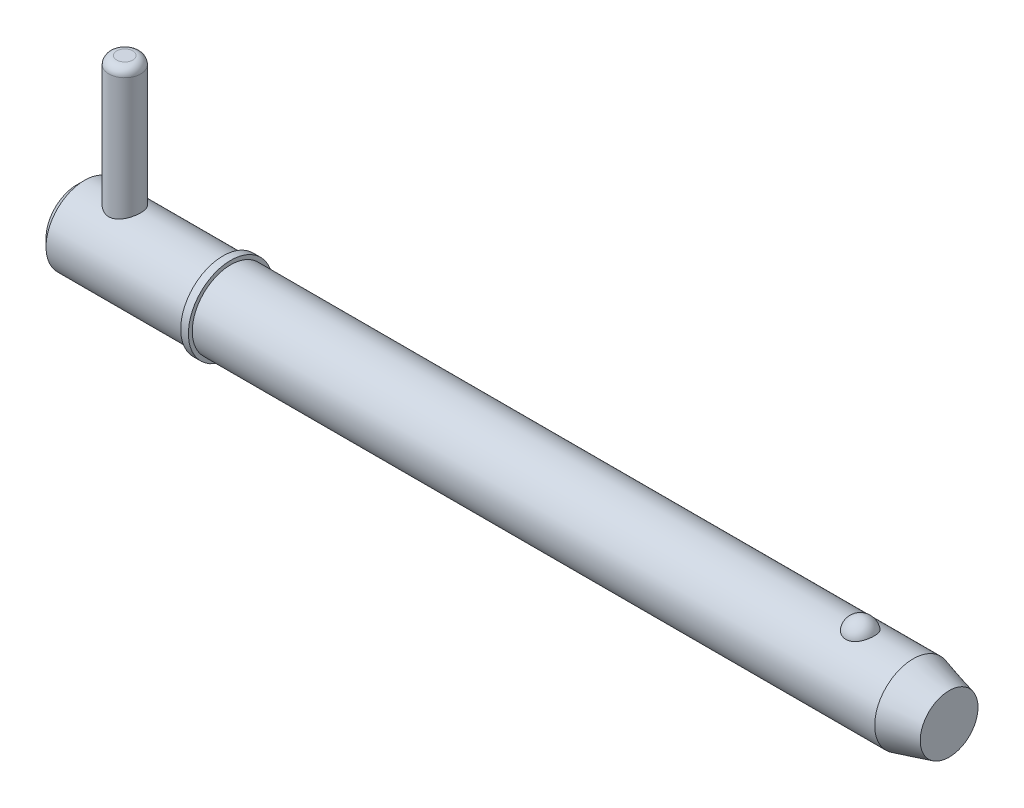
ISO-10303-21;
HEADER;
FILE_DESCRIPTION(('STEP AP214'),'2;1');
FILE_NAME('part.step','',(''),(''),'','','');
FILE_SCHEMA(('AUTOMOTIVE_DESIGN { 1 0 10303 214 1 1 1 1 }'));
ENDSEC;
DATA;
#1=APPLICATION_CONTEXT('core data for automotive mechanical design processes');
#2=APPLICATION_PROTOCOL_DEFINITION('international standard','automotive_design',2000,#1);
#3=PRODUCT_CONTEXT('',#1,'mechanical');
#4=PRODUCT('Part','Part','',(#3));
#5=PRODUCT_RELATED_PRODUCT_CATEGORY('part','',(#4));
#6=PRODUCT_DEFINITION_FORMATION('','',#4);
#7=PRODUCT_DEFINITION_CONTEXT('part definition',#1,'design');
#8=PRODUCT_DEFINITION('design','',#6,#7);
#9=PRODUCT_DEFINITION_SHAPE('','',#8);
#10=(LENGTH_UNIT() NAMED_UNIT(*) SI_UNIT(.MILLI.,.METRE.));
#11=(NAMED_UNIT(*) PLANE_ANGLE_UNIT() SI_UNIT($,.RADIAN.));
#12=(NAMED_UNIT(*) SI_UNIT($,.STERADIAN.) SOLID_ANGLE_UNIT());
#13=UNCERTAINTY_MEASURE_WITH_UNIT(LENGTH_MEASURE(1.E-05),#10,'distance_accuracy_value','');
#14=(GEOMETRIC_REPRESENTATION_CONTEXT(3) GLOBAL_UNCERTAINTY_ASSIGNED_CONTEXT((#13)) GLOBAL_UNIT_ASSIGNED_CONTEXT((#10,
#11,#12)) REPRESENTATION_CONTEXT('',''));
#15=CARTESIAN_POINT('',(0.,0.,0.));
#16=DIRECTION('',(0.,0.,1.));
#17=DIRECTION('',(1.,0.,0.));
#18=AXIS2_PLACEMENT_3D('',#15,#16,#17);
#19=CARTESIAN_POINT('',(5.94,20.635,0.));
#20=DIRECTION('',(0.,-1.,0.));
#21=DIRECTION('',(0.,0.,-1.));
#22=AXIS2_PLACEMENT_3D('',#19,#20,#21);
#23=CYLINDRICAL_SURFACE('',#22,1.98);
#24=CARTESIAN_POINT('',(5.94,-3.775,0.));
#25=DIRECTION('',(0.,1.,0.));
#26=DIRECTION('',(0.,0.,1.));
#27=AXIS2_PLACEMENT_3D('',#24,#25,#26);
#28=CIRCLE('',#27,1.98);
#29=CARTESIAN_POINT('',(5.94,-3.775,1.98));
#30=VERTEX_POINT('',#29);
#31=EDGE_CURVE('P0_E25',#30,#30,#28,.T.);
#32=ORIENTED_EDGE('',*,*,#31,.T.);
#33=EDGE_LOOP('',(#32));
#34=FACE_BOUND('',#33,.T.);
#35=CARTESIAN_POINT('',(5.94,19.645,0.));
#36=DIRECTION('',(0.,1.,0.));
#37=DIRECTION('',(0.,0.,1.));
#38=AXIS2_PLACEMENT_3D('',#35,#36,#37);
#39=CIRCLE('',#38,1.98);
#40=CARTESIAN_POINT('',(5.94,19.645,1.98));
#41=VERTEX_POINT('',#40);
#42=EDGE_CURVE('P0_E29',#41,#41,#39,.F.);
#43=ORIENTED_EDGE('',*,*,#42,.T.);
#44=EDGE_LOOP('',(#43));
#45=FACE_BOUND('',#44,.T.);
#46=ADVANCED_FACE('P0_F14',(#34,#45),#23,.T.);
#47=CARTESIAN_POINT('',(5.94,20.635,0.));
#48=DIRECTION('',(0.,1.,0.));
#49=DIRECTION('',(0.,0.,1.));
#50=AXIS2_PLACEMENT_3D('',#47,#48,#49);
#51=PLANE('',#50);
#52=CARTESIAN_POINT('',(5.94,20.635,0.));
#53=DIRECTION('',(0.,1.,0.));
#54=DIRECTION('',(0.,0.,1.));
#55=AXIS2_PLACEMENT_3D('',#52,#53,#54);
#56=CIRCLE('',#55,0.99);
#57=CARTESIAN_POINT('',(5.94,20.635,0.99));
#58=VERTEX_POINT('',#57);
#59=EDGE_CURVE('P0_E10',#58,#58,#56,.T.);
#60=ORIENTED_EDGE('',*,*,#59,.T.);
#61=EDGE_LOOP('',(#60));
#62=FACE_BOUND('',#61,.T.);
#63=ADVANCED_FACE('P0_F46',(#62),#51,.T.);
#64=CARTESIAN_POINT('',(5.94,-4.765,0.));
#65=DIRECTION('',(0.,1.,0.));
#66=DIRECTION('',(0.,0.,1.));
#67=AXIS2_PLACEMENT_3D('',#64,#65,#66);
#68=PLANE('',#67);
#69=CARTESIAN_POINT('',(5.94,-4.765,0.));
#70=DIRECTION('',(0.,1.,0.));
#71=DIRECTION('',(0.,0.,1.));
#72=AXIS2_PLACEMENT_3D('',#69,#70,#71);
#73=CIRCLE('',#72,0.99);
#74=CARTESIAN_POINT('',(5.94,-4.765,0.99));
#75=VERTEX_POINT('',#74);
#76=EDGE_CURVE('P0_E21',#75,#75,#73,.F.);
#77=ORIENTED_EDGE('',*,*,#76,.T.);
#78=EDGE_LOOP('',(#77));
#79=FACE_BOUND('',#78,.T.);
#80=ADVANCED_FACE('P0_F43',(#79),#68,.F.);
#81=CARTESIAN_POINT('',(5.94,-3.775,0.));
#82=DIRECTION('',(0.,1.,0.));
#83=DIRECTION('',(0.,0.,1.));
#84=AXIS2_PLACEMENT_3D('',#81,#82,#83);
#85=DEGENERATE_TOROIDAL_SURFACE('',#84,0.99,0.99,.T.);
#86=ORIENTED_EDGE('',*,*,#76,.F.);
#87=EDGE_LOOP('',(#86));
#88=FACE_BOUND('',#87,.T.);
#89=ORIENTED_EDGE('',*,*,#31,.F.);
#90=EDGE_LOOP('',(#89));
#91=FACE_BOUND('',#90,.T.);
#92=ADVANCED_FACE('P0_F38',(#88,#91),#85,.T.);
#93=CARTESIAN_POINT('',(5.94,19.645,0.));
#94=DIRECTION('',(0.,1.,0.));
#95=DIRECTION('',(0.,0.,1.));
#96=AXIS2_PLACEMENT_3D('',#93,#94,#95);
#97=DEGENERATE_TOROIDAL_SURFACE('',#96,0.99,0.99,.T.);
#98=ORIENTED_EDGE('',*,*,#42,.F.);
#99=EDGE_LOOP('',(#98));
#100=FACE_BOUND('',#99,.T.);
#101=ORIENTED_EDGE('',*,*,#59,.F.);
#102=EDGE_LOOP('',(#101));
#103=FACE_BOUND('',#102,.T.);
#104=ADVANCED_FACE('P0_F16',(#100,#103),#97,.T.);
#105=CLOSED_SHELL('',(#46,#63,#80,#92,#104));
#106=MANIFOLD_SOLID_BREP('P0_B1',#105);
#107=CARTESIAN_POINT('',(0.,0.,0.));
#108=DIRECTION('',(1.,0.,0.));
#109=DIRECTION('',(0.,0.,-1.));
#110=AXIS2_PLACEMENT_3D('',#107,#108,#109);
#111=CYLINDRICAL_SURFACE('',#110,4.765);
#112=CARTESIAN_POINT('',(103.504194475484,0.,0.));
#113=DIRECTION('',(1.,0.,0.));
#114=DIRECTION('',(0.,0.,-1.));
#115=AXIS2_PLACEMENT_3D('',#112,#113,#114);
#116=CIRCLE('',#115,4.765);
#117=CARTESIAN_POINT('',(103.504194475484,0.,-4.765));
#118=VERTEX_POINT('',#117);
#119=EDGE_CURVE('P1_E81',#118,#118,#116,.T.);
#120=ORIENTED_EDGE('',*,*,#119,.F.);
#121=EDGE_LOOP('',(#120));
#122=FACE_BOUND('',#121,.T.);
#123=CARTESIAN_POINT('',(19.05,0.,0.));
#124=DIRECTION('',(1.,0.,0.));
#125=DIRECTION('',(0.,0.,-1.));
#126=AXIS2_PLACEMENT_3D('',#123,#124,#125);
#127=CIRCLE('',#126,4.765);
#128=CARTESIAN_POINT('',(19.05,0.,-4.765));
#129=VERTEX_POINT('',#128);
#130=EDGE_CURVE('P1_E85',#129,#129,#127,.T.);
#131=ORIENTED_EDGE('',*,*,#130,.T.);
#132=EDGE_LOOP('',(#131));
#133=FACE_BOUND('',#132,.T.);
#134=CARTESIAN_POINT('',(96.951020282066,4.42764777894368,1.76101111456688));
#135=CARTESIAN_POINT('',(96.8597212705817,4.42764470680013,1.76101422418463));
#136=CARTESIAN_POINT('',(96.7684468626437,4.43059091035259,1.75366340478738));
#137=CARTESIAN_POINT('',(96.5886154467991,4.44201846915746,1.72451180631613));
#138=CARTESIAN_POINT('',(96.5000577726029,4.45049845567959,1.70271460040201));
#139=CARTESIAN_POINT('',(96.3282570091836,4.47200516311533,1.6453937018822));
#140=CARTESIAN_POINT('',(96.2450064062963,4.48502527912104,1.60988994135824));
#141=CARTESIAN_POINT('',(96.0857633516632,4.51419542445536,1.52617873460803));
#142=CARTESIAN_POINT('',(96.0097723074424,4.53034605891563,1.47796883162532));
#143=CARTESIAN_POINT('',(95.8647445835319,4.5645931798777,1.36860494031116));
#144=CARTESIAN_POINT('',(95.7959645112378,4.58273170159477,1.30712420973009));
#145=CARTESIAN_POINT('',(95.6693423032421,4.61870302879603,1.1737020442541));
#146=CARTESIAN_POINT('',(95.6115021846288,4.63653577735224,1.1017586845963));
#147=CARTESIAN_POINT('',(95.5055709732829,4.67090140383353,0.945806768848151));
#148=CARTESIAN_POINT('',(95.4580305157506,4.68734068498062,0.861402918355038));
#149=CARTESIAN_POINT('',(95.3770817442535,4.71628466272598,0.685442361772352));
#150=CARTESIAN_POINT('',(95.3436747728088,4.72878898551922,0.59388497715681));
#151=CARTESIAN_POINT('',(95.291287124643,4.74874061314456,0.404781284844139));
#152=CARTESIAN_POINT('',(95.2725178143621,4.75611366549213,0.30716844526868));
#153=CARTESIAN_POINT('',(95.2505846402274,4.76475393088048,0.109940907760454));
#154=CARTESIAN_POINT('',(95.2474205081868,4.76602124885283,0.0103262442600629));
#155=CARTESIAN_POINT('',(95.2567405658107,4.76232928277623,-0.187629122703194));
#156=CARTESIAN_POINT('',(95.2691588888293,4.7573962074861,-0.28597342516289));
#157=CARTESIAN_POINT('',(95.3092804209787,4.74184975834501,-0.479027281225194));
#158=CARTESIAN_POINT('',(95.3369839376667,4.7312362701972,-0.573736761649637));
#159=CARTESIAN_POINT('',(95.4071581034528,4.70540026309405,-0.756973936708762));
#160=CARTESIAN_POINT('',(95.4496460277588,4.69017235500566,-0.845494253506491));
#161=CARTESIAN_POINT('',(95.548520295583,4.6566986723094,-1.01378033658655));
#162=CARTESIAN_POINT('',(95.6049076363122,4.63845268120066,-1.09354547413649));
#163=CARTESIAN_POINT('',(95.730552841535,4.60085438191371,-1.24228523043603));
#164=CARTESIAN_POINT('',(95.7998439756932,4.58149930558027,-1.31123108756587));
#165=CARTESIAN_POINT('',(95.9496066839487,4.54391653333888,-1.43607409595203));
#166=CARTESIAN_POINT('',(96.0300771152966,4.52568872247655,-1.49197257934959));
#167=CARTESIAN_POINT('',(96.1981500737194,4.49293007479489,-1.58786764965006));
#168=CARTESIAN_POINT('',(96.2855445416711,4.47832346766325,-1.62820219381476));
#169=CARTESIAN_POINT('',(96.466553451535,4.45406011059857,-1.69345757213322));
#170=CARTESIAN_POINT('',(96.5601655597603,4.44440151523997,-1.71838415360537));
#171=CARTESIAN_POINT('',(96.7458939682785,4.43159888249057,-1.75112843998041));
#172=CARTESIAN_POINT('',(96.837849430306,4.42815213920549,-1.75974223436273));
#173=CARTESIAN_POINT('',(97.0219658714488,4.427247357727,-1.76201865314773));
#174=CARTESIAN_POINT('',(97.1141268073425,4.42978816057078,-1.7556841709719));
#175=CARTESIAN_POINT('',(97.2931292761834,4.4403864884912,-1.72869560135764));
#176=CARTESIAN_POINT('',(97.3800474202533,4.44827555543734,-1.70847853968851));
#177=CARTESIAN_POINT('',(97.5491314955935,4.46852246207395,-1.65479562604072));
#178=CARTESIAN_POINT('',(97.6312970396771,4.48088066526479,-1.62132869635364));
#179=CARTESIAN_POINT('',(97.7905916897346,4.50907357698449,-1.54120560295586));
#180=CARTESIAN_POINT('',(97.8675700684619,4.52497884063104,-1.49427526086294));
#181=CARTESIAN_POINT('',(98.0127080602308,4.55845148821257,-1.38881222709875));
#182=CARTESIAN_POINT('',(98.0808656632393,4.57601924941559,-1.33027689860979));
#183=CARTESIAN_POINT('',(98.2100990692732,4.61196537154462,-1.19991049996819));
#184=CARTESIAN_POINT('',(98.2706562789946,4.63034074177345,-1.12756415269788));
#185=CARTESIAN_POINT('',(98.3792797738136,4.66513959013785,-0.973612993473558));
#186=CARTESIAN_POINT('',(98.4273438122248,4.68156271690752,-0.892006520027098));
#187=CARTESIAN_POINT('',(98.511383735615,4.71130224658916,-0.718892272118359));
#188=CARTESIAN_POINT('',(98.5469185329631,4.724501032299,-0.627149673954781));
#189=CARTESIAN_POINT('',(98.6029522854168,4.74571823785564,-0.438611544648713));
#190=CARTESIAN_POINT('',(98.623450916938,4.75373654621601,-0.341815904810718));
#191=CARTESIAN_POINT('',(98.6490338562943,4.76378905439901,-0.145633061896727));
#192=CARTESIAN_POINT('',(98.654076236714,4.76580697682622,-0.0462395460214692));
#193=CARTESIAN_POINT('',(98.6485239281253,4.7636057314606,0.152038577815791));
#194=CARTESIAN_POINT('',(98.6379294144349,4.75938663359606,0.250923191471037));
#195=CARTESIAN_POINT('',(98.6013875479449,4.74516937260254,0.445004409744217));
#196=CARTESIAN_POINT('',(98.5754964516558,4.73519238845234,0.540213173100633));
#197=CARTESIAN_POINT('',(98.5089273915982,4.7104939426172,0.724662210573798));
#198=CARTESIAN_POINT('',(98.468248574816,4.69577220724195,0.813902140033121));
#199=CARTESIAN_POINT('',(98.3727177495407,4.66303767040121,0.984313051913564));
#200=CARTESIAN_POINT('',(98.3178042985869,4.64501070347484,1.06544688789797));
#201=CARTESIAN_POINT('',(98.1950496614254,4.60764678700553,1.21692673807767));
#202=CARTESIAN_POINT('',(98.1272086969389,4.58830985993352,1.2872729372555));
#203=CARTESIAN_POINT('',(97.9805480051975,4.55060370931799,1.41479271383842));
#204=CARTESIAN_POINT('',(97.9017918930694,4.53222967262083,1.47203785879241));
#205=CARTESIAN_POINT('',(97.7349890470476,4.49849576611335,1.57212016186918));
#206=CARTESIAN_POINT('',(97.6469417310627,4.48313608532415,1.61495641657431));
#207=CARTESIAN_POINT('',(97.4597918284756,4.45676184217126,1.68642657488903));
#208=CARTESIAN_POINT('',(97.3603653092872,4.44598302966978,1.71430590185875));
#209=CARTESIAN_POINT('',(97.1576210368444,4.43142918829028,1.75159258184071));
#210=CARTESIAN_POINT('',(97.0543049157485,4.42765125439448,1.76100759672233));
#211=CARTESIAN_POINT('',(96.951020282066,4.42764777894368,1.76101111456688));
#212=B_SPLINE_CURVE_WITH_KNOTS('',3,(#134,#135,#136,#137,#138,#139,#140,#141,#142,#143,#144,
#145,#146,#147,#148,#149,#150,#151,#152,#153,#154,#155,#156,#157,#158,#159,#160,#161,#162,#163,
#164,#165,#166,#167,#168,#169,#170,#171,#172,#173,#174,#175,#176,#177,#178,#179,#180,#181,#182,
#183,#184,#185,#186,#187,#188,#189,#190,#191,#192,#193,#194,#195,#196,#197,#198,#199,#200,#201,
#202,#203,#204,#205,#206,#207,#208,#209,#210,#211),.UNSPECIFIED.,.T.,.F.,(4,2,2,2,2,2,2,2,2,2,2,
2,2,2,2,2,2,2,2,2,2,2,2,2,2,2,2,2,2,2,2,2,2,2,2,2,2,2,4),(0.,0.273517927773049,
0.546968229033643,0.820022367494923,1.09312934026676,1.37393946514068,1.65480131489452,
1.94820420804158,2.24163496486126,2.53922817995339,2.8368162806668,3.13315071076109,
3.42949110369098,3.72617893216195,4.02288805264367,4.32037303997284,4.61782764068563,
4.9084009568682,5.19886582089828,5.4747485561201,5.75057789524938,6.01809977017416,
6.2856434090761,6.55907787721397,6.83257454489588,7.11962987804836,7.40673679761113,
7.70312663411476,7.99952284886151,8.29672237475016,8.59391856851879,8.89002850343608,
9.18615552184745,9.483582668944,9.78100471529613,10.0767610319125,10.3725358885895,
10.6820893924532,10.991514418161),.UNSPECIFIED.);
#213=CARTESIAN_POINT('',(96.951020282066,4.42764777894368,1.76101111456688));
#214=VERTEX_POINT('',#213);
#215=EDGE_CURVE('P1_E35',#214,#214,#212,.T.);
#216=ORIENTED_EDGE('',*,*,#215,.T.);
#217=EDGE_LOOP('',(#216));
#218=FACE_BOUND('',#217,.T.);
#219=ADVANCED_FACE('P1_F13',(#122,#133,#218),#111,.T.);
#220=CARTESIAN_POINT('',(0.,0.,0.));
#221=DIRECTION('',(-1.,0.,0.));
#222=DIRECTION('',(0.,0.,1.));
#223=AXIS2_PLACEMENT_3D('',#220,#221,#222);
#224=PLANE('',#223);
#225=CARTESIAN_POINT('',(0.,0.,0.));
#226=DIRECTION('',(1.,0.,0.));
#227=DIRECTION('',(0.,0.,-1.));
#228=AXIS2_PLACEMENT_3D('',#225,#226,#227);
#229=CIRCLE('',#228,3.812);
#230=CARTESIAN_POINT('',(0.,0.,-3.812));
#231=VERTEX_POINT('',#230);
#232=EDGE_CURVE('P1_E9',#231,#231,#229,.T.);
#233=ORIENTED_EDGE('',*,*,#232,.F.);
#234=EDGE_LOOP('',(#233));
#235=FACE_BOUND('',#234,.T.);
#236=ADVANCED_FACE('P1_F15',(#235),#224,.T.);
#237=CARTESIAN_POINT('',(0.952999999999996,0.,0.));
#238=DIRECTION('',(1.,0.,0.));
#239=DIRECTION('',(0.,0.,-1.));
#240=AXIS2_PLACEMENT_3D('',#237,#238,#239);
#241=CONICAL_SURFACE('',#240,4.765,0.78539816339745);
#242=ORIENTED_EDGE('',*,*,#232,.T.);
#243=EDGE_LOOP('',(#242));
#244=FACE_BOUND('',#243,.T.);
#245=CARTESIAN_POINT('',(0.952999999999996,0.,0.));
#246=DIRECTION('',(1.,0.,0.));
#247=DIRECTION('',(0.,0.,-1.));
#248=AXIS2_PLACEMENT_3D('',#245,#246,#247);
#249=CIRCLE('',#248,4.765);
#250=CARTESIAN_POINT('',(0.952999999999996,0.,-4.765));
#251=VERTEX_POINT('',#250);
#252=EDGE_CURVE('P1_E26',#251,#251,#249,.T.);
#253=ORIENTED_EDGE('',*,*,#252,.F.);
#254=EDGE_LOOP('',(#253));
#255=FACE_BOUND('',#254,.T.);
#256=ADVANCED_FACE('P1_F77',(#244,#255),#241,.T.);
#257=CARTESIAN_POINT('',(0.,0.,0.));
#258=DIRECTION('',(1.,0.,0.));
#259=DIRECTION('',(0.,0.,-1.));
#260=AXIS2_PLACEMENT_3D('',#257,#258,#259);
#261=CYLINDRICAL_SURFACE('',#260,4.765);
#262=CARTESIAN_POINT('',(5.94,-4.33414639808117,1.98));
#263=CARTESIAN_POINT('',(5.83435484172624,-4.33415447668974,1.97999169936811));
#264=CARTESIAN_POINT('',(5.72854887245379,-4.33806396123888,1.97149330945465));
#265=CARTESIAN_POINT('',(5.51998191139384,-4.35319906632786,1.93783487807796));
#266=CARTESIAN_POINT('',(5.41723000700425,-4.3644446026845,1.91262947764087));
#267=CARTESIAN_POINT('',(5.21817294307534,-4.39274225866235,1.84670269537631));
#268=CARTESIAN_POINT('',(5.12184344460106,-4.40977076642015,1.80604432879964));
#269=CARTESIAN_POINT('',(4.93740039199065,-4.44768106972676,1.71055160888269));
#270=CARTESIAN_POINT('',(4.84928487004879,-4.46856193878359,1.65572066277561));
#271=CARTESIAN_POINT('',(4.67826533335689,-4.51326966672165,1.52981120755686));
#272=CARTESIAN_POINT('',(4.59593118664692,-4.53719608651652,1.45799365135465));
#273=CARTESIAN_POINT('',(4.44405452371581,-4.58448035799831,1.30170177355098));
#274=CARTESIAN_POINT('',(4.37451692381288,-4.60783798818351,1.21722260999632));
#275=CARTESIAN_POINT('',(4.24730683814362,-4.65256187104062,1.03353484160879));
#276=CARTESIAN_POINT('',(4.19027484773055,-4.67379892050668,0.933848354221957));
#277=CARTESIAN_POINT('',(4.0940363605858,-4.7106711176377,0.7252544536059));
#278=CARTESIAN_POINT('',(4.05482199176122,-4.72630873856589,0.61635113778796));
#279=CARTESIAN_POINT('',(3.99739515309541,-4.74951416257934,0.398397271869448));
#280=CARTESIAN_POINT('',(3.97820018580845,-4.7574579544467,0.289646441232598));
#281=CARTESIAN_POINT('',(3.95818309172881,-4.76574596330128,0.0701967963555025));
#282=CARTESIAN_POINT('',(3.95735355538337,-4.76609324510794,-0.0405012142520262));
#283=CARTESIAN_POINT('',(3.9735743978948,-4.75937098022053,-0.253561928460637));
#284=CARTESIAN_POINT('',(3.98954548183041,-4.75274912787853,-0.356023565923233));
#285=CARTESIAN_POINT('',(4.03706504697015,-4.73344665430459,-0.556659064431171));
#286=CARTESIAN_POINT('',(4.06861467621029,-4.72076558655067,-0.654832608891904));
#287=CARTESIAN_POINT('',(4.14677192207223,-4.69032846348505,-0.845904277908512));
#288=CARTESIAN_POINT('',(4.19360181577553,-4.67249797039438,-0.938699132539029));
#289=CARTESIAN_POINT('',(4.30077315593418,-4.63350852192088,-1.11535616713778));
#290=CARTESIAN_POINT('',(4.3611193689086,-4.61234839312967,-1.19921518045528));
#291=CARTESIAN_POINT('',(4.49853487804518,-4.56707259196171,-1.3618711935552));
#292=CARTESIAN_POINT('',(4.57648039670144,-4.5428537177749,-1.43990029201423));
#293=CARTESIAN_POINT('',(4.74440779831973,-4.49530722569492,-1.58211009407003));
#294=CARTESIAN_POINT('',(4.83439425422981,-4.47197995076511,-1.64628551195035));
#295=CARTESIAN_POINT('',(5.02755026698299,-4.42812342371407,-1.76092221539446));
#296=CARTESIAN_POINT('',(5.13105348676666,-4.40770990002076,-1.81086937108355));
#297=CARTESIAN_POINT('',(5.34607555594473,-4.37336901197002,-1.89231211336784));
#298=CARTESIAN_POINT('',(5.45758864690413,-4.3594370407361,-1.92382080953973));
#299=CARTESIAN_POINT('',(5.67777275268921,-4.34077746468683,-1.96554536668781));
#300=CARTESIAN_POINT('',(5.78616167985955,-4.33551319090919,-1.9770057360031));
#301=CARTESIAN_POINT('',(6.00341835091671,-4.33325118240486,-1.98196183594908));
#302=CARTESIAN_POINT('',(6.11228591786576,-4.33625061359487,-1.97546372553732));
#303=CARTESIAN_POINT('',(6.32012423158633,-4.34962383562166,-1.94582288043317));
#304=CARTESIAN_POINT('',(6.41928436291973,-4.35951709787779,-1.92376364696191));
#305=CARTESIAN_POINT('',(6.61241543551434,-4.38495043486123,-1.86506038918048));
#306=CARTESIAN_POINT('',(6.70638516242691,-4.40049182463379,-1.82841296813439));
#307=CARTESIAN_POINT('',(6.89090272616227,-4.43627016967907,-1.73985559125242));
#308=CARTESIAN_POINT('',(6.98113841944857,-4.45667771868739,-1.68736639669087));
#309=CARTESIAN_POINT('',(7.1519532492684,-4.49964530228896,-1.56919282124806));
#310=CARTESIAN_POINT('',(7.232528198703,-4.52220626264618,-1.50350275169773));
#311=CARTESIAN_POINT('',(7.38851617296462,-4.56914071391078,-1.35452895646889));
#312=CARTESIAN_POINT('',(7.46298462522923,-4.5935132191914,-1.27025197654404));
#313=CARTESIAN_POINT('',(7.59689029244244,-4.63962841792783,-1.08983181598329));
#314=CARTESIAN_POINT('',(7.65632644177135,-4.66137092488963,-0.993687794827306));
#315=CARTESIAN_POINT('',(7.75840361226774,-4.69991192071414,-0.791608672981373));
#316=CARTESIAN_POINT('',(7.80100481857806,-4.71669866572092,-0.685651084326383));
#317=CARTESIAN_POINT('',(7.86746997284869,-4.74331408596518,-0.467197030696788));
#318=CARTESIAN_POINT('',(7.8913450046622,-4.75314687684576,-0.354704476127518));
#319=CARTESIAN_POINT('',(7.91828971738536,-4.76427543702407,-0.134819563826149));
#320=CARTESIAN_POINT('',(7.92269147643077,-4.76611762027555,-0.027616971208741));
#321=CARTESIAN_POINT('',(7.91414154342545,-4.76256684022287,0.185959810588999));
#322=CARTESIAN_POINT('',(7.90119286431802,-4.75717513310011,0.292334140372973));
#323=CARTESIAN_POINT('',(7.85926572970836,-4.74004856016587,0.497383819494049));
#324=CARTESIAN_POINT('',(7.83086647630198,-4.72854322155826,0.596198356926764));
#325=CARTESIAN_POINT('',(7.75947503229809,-4.70045111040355,0.787624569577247));
#326=CARTESIAN_POINT('',(7.71648006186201,-4.68386336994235,0.880235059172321));
#327=CARTESIAN_POINT('',(7.6149456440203,-4.64628321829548,1.06122875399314));
#328=CARTESIAN_POINT('',(7.55579211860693,-4.62512577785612,1.14923242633));
#329=CARTESIAN_POINT('',(7.42451813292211,-4.58091700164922,1.31443888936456));
#330=CARTESIAN_POINT('',(7.35239289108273,-4.5578649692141,1.39163767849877));
#331=CARTESIAN_POINT('',(7.19146107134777,-4.51050832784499,1.53847013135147));
#332=CARTESIAN_POINT('',(7.10185635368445,-4.48622440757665,1.60723941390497));
#333=CARTESIAN_POINT('',(6.91164948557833,-4.44076541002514,1.72888900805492));
#334=CARTESIAN_POINT('',(6.81104124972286,-4.41959206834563,1.78176046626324));
#335=CARTESIAN_POINT('',(6.60181953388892,-4.38318936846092,1.86953227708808));
#336=CARTESIAN_POINT('',(6.49325511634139,-4.3679267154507,1.90453365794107));
#337=CARTESIAN_POINT('',(6.32681512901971,-4.35102038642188,1.94268459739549));
#338=CARTESIAN_POINT('',(6.27079191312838,-4.34638447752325,1.953006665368));
#339=CARTESIAN_POINT('',(6.15793999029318,-4.33925923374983,1.96879053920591));
#340=CARTESIAN_POINT('',(6.10111188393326,-4.33676837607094,1.97425579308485));
#341=CARTESIAN_POINT('',(6.00947316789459,-4.33456308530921,1.97908711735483));
#342=CARTESIAN_POINT('',(5.97474528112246,-4.33414374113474,1.98000272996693));
#343=CARTESIAN_POINT('',(5.94,-4.33414639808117,1.98));
#344=B_SPLINE_CURVE_WITH_KNOTS('',3,(#262,#263,#264,#265,#266,#267,#268,#269,#270,#271,#272,
#273,#274,#275,#276,#277,#278,#279,#280,#281,#282,#283,#284,#285,#286,#287,#288,#289,#290,#291,
#292,#293,#294,#295,#296,#297,#298,#299,#300,#301,#302,#303,#304,#305,#306,#307,#308,#309,#310,
#311,#312,#313,#314,#315,#316,#317,#318,#319,#320,#321,#322,#323,#324,#325,#326,#327,#328,#329,
#330,#331,#332,#333,#334,#335,#336,#337,#338,#339,#340,#341,#342,#343),.UNSPECIFIED.,.T.,.F.,(4,
2,2,2,2,2,2,2,2,2,2,2,2,2,2,2,2,2,2,2,2,2,2,2,2,2,2,2,2,2,2,2,2,2,2,2,2,2,2,2,4),(0.,
0.316814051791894,0.634491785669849,0.950887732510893,1.2672076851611,1.60127705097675,
1.93547449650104,2.28407463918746,2.63252061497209,2.96292077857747,3.29318763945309,
3.60346227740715,3.91375978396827,4.22878888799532,4.54392926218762,4.88117914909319,
5.21855748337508,5.56691259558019,5.91501972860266,6.24062939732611,6.56612741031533,
6.87094948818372,7.17584258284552,7.49361276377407,7.81152017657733,8.15513975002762,
8.4987836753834,8.8432355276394,9.18748334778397,9.50777781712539,9.8280166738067,
10.1370037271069,10.4460496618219,10.7690461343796,11.0921619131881,11.4371238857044,
11.7822776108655,12.1254577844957,12.2967183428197,12.4678572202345,12.5720531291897),.UNSPECIFIED.);
#345=CARTESIAN_POINT('',(5.94,-4.33414639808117,1.98));
#346=VERTEX_POINT('',#345);
#347=EDGE_CURVE('P1_E17',#346,#346,#344,.T.);
#348=ORIENTED_EDGE('',*,*,#347,.F.);
#349=EDGE_LOOP('',(#348));
#350=FACE_BOUND('',#349,.T.);
#351=CARTESIAN_POINT('',(5.94,4.33414639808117,1.98));
#352=CARTESIAN_POINT('',(6.04564515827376,4.33415447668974,1.97999169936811));
#353=CARTESIAN_POINT('',(6.15145112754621,4.33806396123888,1.97149330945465));
#354=CARTESIAN_POINT('',(6.36001808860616,4.35319906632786,1.93783487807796));
#355=CARTESIAN_POINT('',(6.46276999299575,4.3644446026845,1.91262947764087));
#356=CARTESIAN_POINT('',(6.66182705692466,4.39274225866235,1.84670269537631));
#357=CARTESIAN_POINT('',(6.75815655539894,4.40977076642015,1.80604432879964));
#358=CARTESIAN_POINT('',(6.94259960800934,4.44768106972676,1.71055160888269));
#359=CARTESIAN_POINT('',(7.03071512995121,4.46856193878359,1.65572066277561));
#360=CARTESIAN_POINT('',(7.20173466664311,4.51326966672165,1.52981120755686));
#361=CARTESIAN_POINT('',(7.28406881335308,4.53719608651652,1.45799365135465));
#362=CARTESIAN_POINT('',(7.43594547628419,4.58448035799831,1.30170177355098));
#363=CARTESIAN_POINT('',(7.50548307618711,4.60783798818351,1.21722260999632));
#364=CARTESIAN_POINT('',(7.63269316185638,4.65256187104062,1.03353484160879));
#365=CARTESIAN_POINT('',(7.68972515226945,4.67379892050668,0.933848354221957));
#366=CARTESIAN_POINT('',(7.7859636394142,4.7106711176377,0.7252544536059));
#367=CARTESIAN_POINT('',(7.82517800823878,4.72630873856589,0.61635113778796));
#368=CARTESIAN_POINT('',(7.88260484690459,4.74951416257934,0.398397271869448));
#369=CARTESIAN_POINT('',(7.90179981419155,4.7574579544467,0.289646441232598));
#370=CARTESIAN_POINT('',(7.92181690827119,4.76574596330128,0.0701967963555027));
#371=CARTESIAN_POINT('',(7.92264644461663,4.76609324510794,-0.040501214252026));
#372=CARTESIAN_POINT('',(7.9064256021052,4.75937098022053,-0.253561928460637));
#373=CARTESIAN_POINT('',(7.89045451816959,4.75274912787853,-0.356023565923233));
#374=CARTESIAN_POINT('',(7.84293495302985,4.73344665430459,-0.55665906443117));
#375=CARTESIAN_POINT('',(7.81138532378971,4.72076558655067,-0.654832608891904));
#376=CARTESIAN_POINT('',(7.73322807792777,4.69032846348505,-0.845904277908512));
#377=CARTESIAN_POINT('',(7.68639818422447,4.67249797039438,-0.938699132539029));
#378=CARTESIAN_POINT('',(7.57922684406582,4.63350852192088,-1.11535616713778));
#379=CARTESIAN_POINT('',(7.5188806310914,4.61234839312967,-1.19921518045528));
#380=CARTESIAN_POINT('',(7.38146512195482,4.56707259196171,-1.3618711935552));
#381=CARTESIAN_POINT('',(7.30351960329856,4.5428537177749,-1.43990029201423));
#382=CARTESIAN_POINT('',(7.13559220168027,4.49530722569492,-1.58211009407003));
#383=CARTESIAN_POINT('',(7.04560574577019,4.47197995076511,-1.64628551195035));
#384=CARTESIAN_POINT('',(6.85244973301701,4.42812342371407,-1.76092221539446));
#385=CARTESIAN_POINT('',(6.74894651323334,4.40770990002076,-1.81086937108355));
#386=CARTESIAN_POINT('',(6.53392444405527,4.37336901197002,-1.89231211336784));
#387=CARTESIAN_POINT('',(6.42241135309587,4.3594370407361,-1.92382080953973));
#388=CARTESIAN_POINT('',(6.20222724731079,4.34077746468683,-1.96554536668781));
#389=CARTESIAN_POINT('',(6.09383832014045,4.33551319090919,-1.9770057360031));
#390=CARTESIAN_POINT('',(5.87658164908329,4.33325118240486,-1.98196183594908));
#391=CARTESIAN_POINT('',(5.76771408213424,4.33625061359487,-1.97546372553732));
#392=CARTESIAN_POINT('',(5.55987576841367,4.34962383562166,-1.94582288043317));
#393=CARTESIAN_POINT('',(5.46071563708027,4.35951709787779,-1.92376364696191));
#394=CARTESIAN_POINT('',(5.26758456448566,4.38495043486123,-1.86506038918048));
#395=CARTESIAN_POINT('',(5.17361483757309,4.40049182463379,-1.82841296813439));
#396=CARTESIAN_POINT('',(4.98909727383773,4.43627016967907,-1.73985559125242));
#397=CARTESIAN_POINT('',(4.89886158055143,4.45667771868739,-1.68736639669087));
#398=CARTESIAN_POINT('',(4.72804675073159,4.49964530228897,-1.56919282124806));
#399=CARTESIAN_POINT('',(4.647471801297,4.52220626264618,-1.50350275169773));
#400=CARTESIAN_POINT('',(4.49148382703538,4.56914071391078,-1.35452895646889));
#401=CARTESIAN_POINT('',(4.41701537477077,4.5935132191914,-1.27025197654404));
#402=CARTESIAN_POINT('',(4.28310970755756,4.63962841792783,-1.08983181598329));
#403=CARTESIAN_POINT('',(4.22367355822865,4.66137092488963,-0.993687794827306));
#404=CARTESIAN_POINT('',(4.12159638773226,4.69991192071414,-0.791608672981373));
#405=CARTESIAN_POINT('',(4.07899518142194,4.71669866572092,-0.685651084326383));
#406=CARTESIAN_POINT('',(4.01253002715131,4.74331408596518,-0.467197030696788));
#407=CARTESIAN_POINT('',(3.98865499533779,4.75314687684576,-0.354704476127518));
#408=CARTESIAN_POINT('',(3.96171028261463,4.76427543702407,-0.134819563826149));
#409=CARTESIAN_POINT('',(3.95730852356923,4.76611762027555,-0.0276169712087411));
#410=CARTESIAN_POINT('',(3.96585845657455,4.76256684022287,0.185959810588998));
#411=CARTESIAN_POINT('',(3.97880713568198,4.75717513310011,0.292334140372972));
#412=CARTESIAN_POINT('',(4.02073427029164,4.74004856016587,0.497383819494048));
#413=CARTESIAN_POINT('',(4.04913352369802,4.72854322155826,0.596198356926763));
#414=CARTESIAN_POINT('',(4.12052496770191,4.70045111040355,0.787624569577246));
#415=CARTESIAN_POINT('',(4.16351993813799,4.68386336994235,0.880235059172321));
#416=CARTESIAN_POINT('',(4.2650543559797,4.64628321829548,1.06122875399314));
#417=CARTESIAN_POINT('',(4.32420788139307,4.62512577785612,1.14923242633));
#418=CARTESIAN_POINT('',(4.45548186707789,4.58091700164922,1.31443888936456));
#419=CARTESIAN_POINT('',(4.52760710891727,4.5578649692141,1.39163767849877));
#420=CARTESIAN_POINT('',(4.68853892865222,4.51050832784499,1.53847013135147));
#421=CARTESIAN_POINT('',(4.77814364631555,4.48622440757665,1.60723941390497));
#422=CARTESIAN_POINT('',(4.96835051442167,4.44076541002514,1.72888900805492));
#423=CARTESIAN_POINT('',(5.06895875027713,4.41959206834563,1.78176046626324));
#424=CARTESIAN_POINT('',(5.27818046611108,4.38318936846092,1.86953227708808));
#425=CARTESIAN_POINT('',(5.38674488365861,4.3679267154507,1.90453365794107));
#426=CARTESIAN_POINT('',(5.55318487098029,4.35102038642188,1.94268459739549));
#427=CARTESIAN_POINT('',(5.60920808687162,4.34638447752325,1.953006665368));
#428=CARTESIAN_POINT('',(5.72206000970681,4.33925923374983,1.96879053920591));
#429=CARTESIAN_POINT('',(5.77888811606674,4.33676837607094,1.97425579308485));
#430=CARTESIAN_POINT('',(5.87052683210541,4.33456308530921,1.97908711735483));
#431=CARTESIAN_POINT('',(5.90525471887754,4.33414374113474,1.98000272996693));
#432=CARTESIAN_POINT('',(5.94,4.33414639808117,1.98));
#433=B_SPLINE_CURVE_WITH_KNOTS('',3,(#351,#352,#353,#354,#355,#356,#357,#358,#359,#360,#361,
#362,#363,#364,#365,#366,#367,#368,#369,#370,#371,#372,#373,#374,#375,#376,#377,#378,#379,#380,
#381,#382,#383,#384,#385,#386,#387,#388,#389,#390,#391,#392,#393,#394,#395,#396,#397,#398,#399,
#400,#401,#402,#403,#404,#405,#406,#407,#408,#409,#410,#411,#412,#413,#414,#415,#416,#417,#418,
#419,#420,#421,#422,#423,#424,#425,#426,#427,#428,#429,#430,#431,#432),.UNSPECIFIED.,.T.,.F.,(4,
2,2,2,2,2,2,2,2,2,2,2,2,2,2,2,2,2,2,2,2,2,2,2,2,2,2,2,2,2,2,2,2,2,2,2,2,2,2,2,4),(0.,
0.316814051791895,0.634491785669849,0.950887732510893,1.2672076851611,1.60127705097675,
1.93547449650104,2.28407463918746,2.63252061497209,2.96292077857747,3.29318763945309,
3.60346227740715,3.91375978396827,4.22878888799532,4.54392926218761,4.88117914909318,
5.21855748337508,5.56691259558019,5.91501972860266,6.24062939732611,6.56612741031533,
6.87094948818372,7.17584258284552,7.49361276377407,7.81152017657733,8.15513975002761,
8.4987836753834,8.84323552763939,9.18748334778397,9.50777781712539,9.8280166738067,
10.1370037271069,10.4460496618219,10.7690461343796,11.0921619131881,11.4371238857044,
11.7822776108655,12.1254577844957,12.2967183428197,12.4678572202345,12.5720531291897),.UNSPECIFIED.);
#434=CARTESIAN_POINT('',(5.94,4.33414639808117,1.98));
#435=VERTEX_POINT('',#434);
#436=EDGE_CURVE('P1_E43',#435,#435,#433,.T.);
#437=ORIENTED_EDGE('',*,*,#436,.F.);
#438=EDGE_LOOP('',(#437));
#439=FACE_BOUND('',#438,.T.);
#440=ORIENTED_EDGE('',*,*,#252,.T.);
#441=EDGE_LOOP('',(#440));
#442=FACE_BOUND('',#441,.T.);
#443=CARTESIAN_POINT('',(18.097,0.,0.));
#444=DIRECTION('',(1.,0.,0.));
#445=DIRECTION('',(0.,0.,-1.));
#446=AXIS2_PLACEMENT_3D('',#443,#444,#445);
#447=CIRCLE('',#446,4.765);
#448=CARTESIAN_POINT('',(18.097,0.,-4.765));
#449=VERTEX_POINT('',#448);
#450=EDGE_CURVE('P1_E31',#449,#449,#447,.T.);
#451=ORIENTED_EDGE('',*,*,#450,.F.);
#452=EDGE_LOOP('',(#451));
#453=FACE_BOUND('',#452,.T.);
#454=ADVANCED_FACE('P1_F103',(#350,#439,#442,#453),#261,.T.);
#455=CARTESIAN_POINT('',(18.097,4.765,0.));
#456=DIRECTION('',(-1.,0.,0.));
#457=DIRECTION('',(0.,0.,1.));
#458=AXIS2_PLACEMENT_3D('',#455,#456,#457);
#459=PLANE('',#458);
#460=ORIENTED_EDGE('',*,*,#450,.T.);
#461=EDGE_LOOP('',(#460));
#462=FACE_BOUND('',#461,.T.);
#463=CARTESIAN_POINT('',(18.097,0.,0.));
#464=DIRECTION('',(1.,0.,0.));
#465=DIRECTION('',(0.,0.,-1.));
#466=AXIS2_PLACEMENT_3D('',#463,#464,#465);
#467=CIRCLE('',#466,5.2415);
#468=CARTESIAN_POINT('',(18.097,0.,-5.2415));
#469=VERTEX_POINT('',#468);
#470=EDGE_CURVE('P1_E91',#469,#469,#467,.T.);
#471=ORIENTED_EDGE('',*,*,#470,.F.);
#472=EDGE_LOOP('',(#471));
#473=FACE_BOUND('',#472,.T.);
#474=ADVANCED_FACE('P1_F100',(#462,#473),#459,.T.);
#475=CARTESIAN_POINT('',(0.,0.,0.));
#476=DIRECTION('',(1.,0.,0.));
#477=DIRECTION('',(0.,0.,-1.));
#478=AXIS2_PLACEMENT_3D('',#475,#476,#477);
#479=CYLINDRICAL_SURFACE('',#478,5.2415);
#480=ORIENTED_EDGE('',*,*,#470,.T.);
#481=EDGE_LOOP('',(#480));
#482=FACE_BOUND('',#481,.T.);
#483=CARTESIAN_POINT('',(19.05,0.,0.));
#484=DIRECTION('',(1.,0.,0.));
#485=DIRECTION('',(0.,0.,-1.));
#486=AXIS2_PLACEMENT_3D('',#483,#484,#485);
#487=CIRCLE('',#486,5.2415);
#488=CARTESIAN_POINT('',(19.05,0.,-5.2415));
#489=VERTEX_POINT('',#488);
#490=EDGE_CURVE('P1_E88',#489,#489,#487,.T.);
#491=ORIENTED_EDGE('',*,*,#490,.F.);
#492=EDGE_LOOP('',(#491));
#493=FACE_BOUND('',#492,.T.);
#494=ADVANCED_FACE('P1_F68',(#482,#493),#479,.T.);
#495=CARTESIAN_POINT('',(19.05,5.2415,0.));
#496=DIRECTION('',(1.,0.,0.));
#497=DIRECTION('',(0.,0.,-1.));
#498=AXIS2_PLACEMENT_3D('',#495,#496,#497);
#499=PLANE('',#498);
#500=ORIENTED_EDGE('',*,*,#490,.T.);
#501=EDGE_LOOP('',(#500));
#502=FACE_BOUND('',#501,.T.);
#503=ORIENTED_EDGE('',*,*,#130,.F.);
#504=EDGE_LOOP('',(#503));
#505=FACE_BOUND('',#504,.T.);
#506=ADVANCED_FACE('P1_F62',(#502,#505),#499,.T.);
#507=CARTESIAN_POINT('',(107.95,0.,0.));
#508=DIRECTION('',(-1.,0.,0.));
#509=DIRECTION('',(0.,0.,1.));
#510=AXIS2_PLACEMENT_3D('',#507,#508,#509);
#511=CONICAL_SURFACE('',#510,3.57375000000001,0.261799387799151);
#512=ORIENTED_EDGE('',*,*,#119,.T.);
#513=EDGE_LOOP('',(#512));
#514=FACE_BOUND('',#513,.T.);
#515=CARTESIAN_POINT('',(107.95,0.,0.));
#516=DIRECTION('',(1.,0.,0.));
#517=DIRECTION('',(0.,0.,-1.));
#518=AXIS2_PLACEMENT_3D('',#515,#516,#517);
#519=CIRCLE('',#518,3.57375000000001);
#520=CARTESIAN_POINT('',(107.95,0.,-3.57375000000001));
#521=VERTEX_POINT('',#520);
#522=EDGE_CURVE('P1_E42',#521,#521,#519,.T.);
#523=ORIENTED_EDGE('',*,*,#522,.F.);
#524=EDGE_LOOP('',(#523));
#525=FACE_BOUND('',#524,.T.);
#526=ADVANCED_FACE('P1_F59',(#514,#525),#511,.T.);
#527=CARTESIAN_POINT('',(107.95,3.57375000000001,0.));
#528=DIRECTION('',(1.,0.,0.));
#529=DIRECTION('',(0.,0.,-1.));
#530=AXIS2_PLACEMENT_3D('',#527,#528,#529);
#531=PLANE('',#530);
#532=ORIENTED_EDGE('',*,*,#522,.T.);
#533=EDGE_LOOP('',(#532));
#534=FACE_BOUND('',#533,.T.);
#535=ADVANCED_FACE('P1_F55',(#534),#531,.T.);
#536=CARTESIAN_POINT('',(96.951020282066,4.2885,0.));
#537=DIRECTION('',(-1.,0.,0.));
#538=DIRECTION('',(0.,1.,0.));
#539=AXIS2_PLACEMENT_3D('',#536,#537,#538);
#540=SPHERICAL_SURFACE('',#539,1.7665);
#541=ORIENTED_EDGE('',*,*,#215,.F.);
#542=EDGE_LOOP('',(#541));
#543=FACE_BOUND('',#542,.T.);
#544=ADVANCED_FACE('P1_F50',(#543),#540,.T.);
#545=CARTESIAN_POINT('',(5.94,-5.2415,0.));
#546=DIRECTION('',(0.,1.,0.));
#547=DIRECTION('',(0.,0.,1.));
#548=AXIS2_PLACEMENT_3D('',#545,#546,#547);
#549=CYLINDRICAL_SURFACE('',#548,1.98);
#550=ORIENTED_EDGE('',*,*,#347,.T.);
#551=EDGE_LOOP('',(#550));
#552=FACE_BOUND('',#551,.T.);
#553=ORIENTED_EDGE('',*,*,#436,.T.);
#554=EDGE_LOOP('',(#553));
#555=FACE_BOUND('',#554,.T.);
#556=ADVANCED_FACE('P1_F54',(#552,#555),#549,.F.);
#557=CLOSED_SHELL('',(#219,#236,#256,#454,#474,#494,#506,#526,#535,#544,#556));
#558=MANIFOLD_SOLID_BREP('P1_B1',#557);
#559=ADVANCED_BREP_SHAPE_REPRESENTATION('',(#18,#106,#558),#14);
#560=SHAPE_DEFINITION_REPRESENTATION(#9,#559);
ENDSEC;
END-ISO-10303-21;
